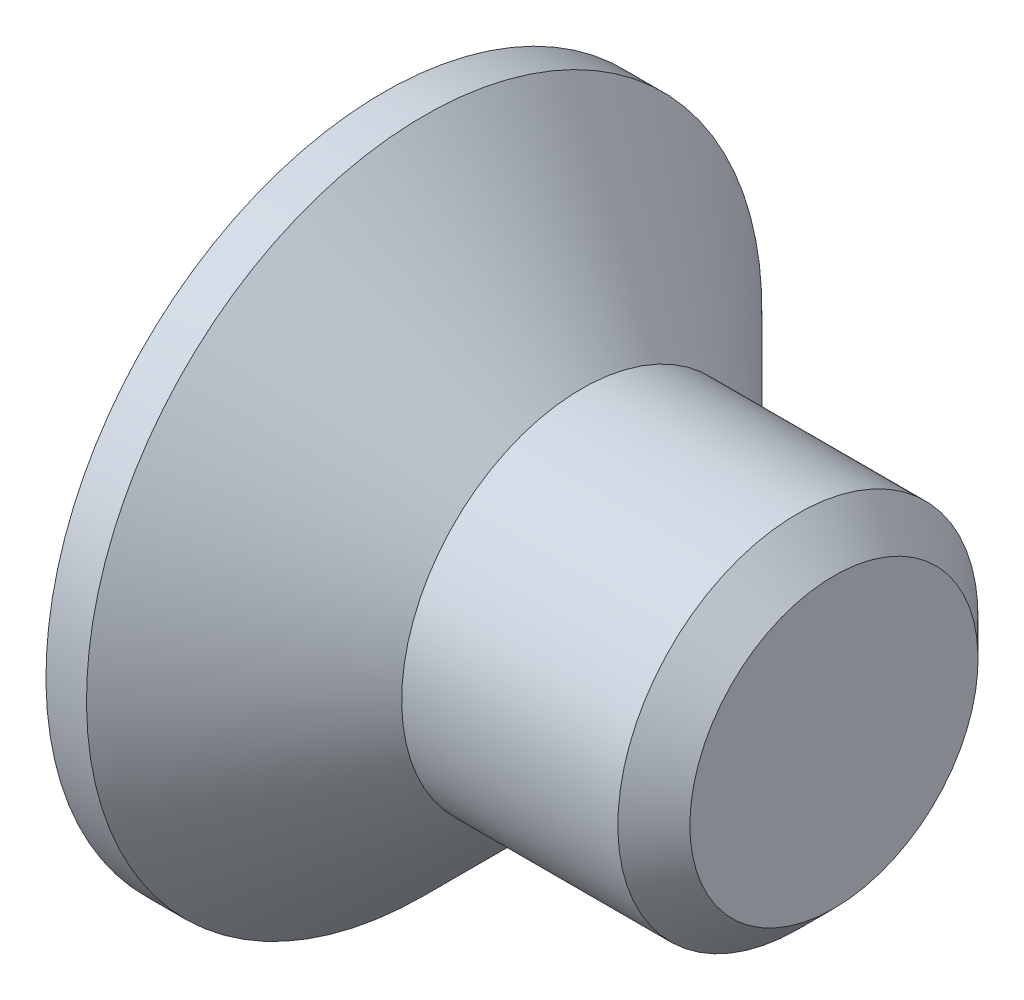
from build123d import *

# Parameters (mm, degrees)
CHAMFER1_SIZE      = 0.4
CUT_EXTRUDE1_DEPTH = 1.9


with BuildPart() as part:
    # Sketch1 → Revolve1 (revolve)
    with BuildSketch(Plane.XY, mode=Mode.PRIVATE) as revolve1_sk:
        Polygon((-2.2, 3.75), (-2.2, 0), (2.8, 0), (2.8, 2), (0, 2), (-1.75, 3.75), align=None)
    revolve(revolve1_sk.sketch.rotate(Axis((-2.2, 0, 0), (1, 0, 0)), 180), axis=Axis((-2.2, 0, 0), (1, 0, 0)))

    # Chamfer1
    chamfer1_edges = [part.edges().sort_by_distance(p)[0] for p in [
        (2.8, 2, 0),
    ]]
    chamfer(chamfer1_edges, length=CHAMFER1_SIZE)

    # Sketch2 → Cut-Extrude1 (cut)
    with BuildSketch(Plane.ZY.offset(2.2)):
        Polygon((-0.55, 2.2), (0.55, 2.2), (0.55, 0.55), (2.2, 0.55), (2.2, -0.55), (0.55, -0.55), (0.55, -2.2), (-0.55, -2.2), (-0.55, -0.55), (-2.2, -0.55), (-2.2, 0.55), (-0.55, 0.55), align=None)
    extrude(amount=-CUT_EXTRUDE1_DEPTH, mode=Mode.SUBTRACT)


solid = part.part
